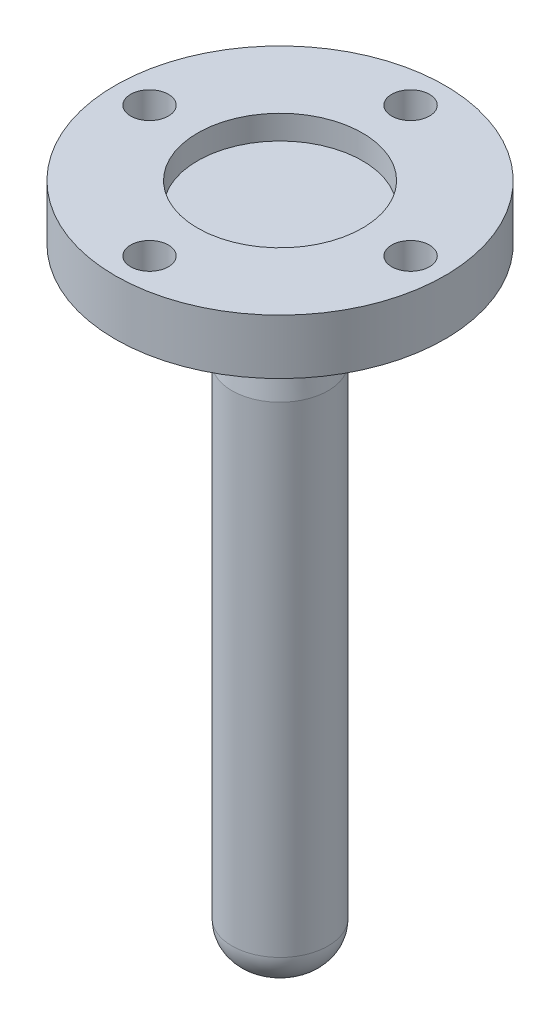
ISO-10303-21;
HEADER;
FILE_DESCRIPTION(('STEP AP214'),'2;1');
FILE_NAME('part.step','',(''),(''),'','','');
FILE_SCHEMA(('AUTOMOTIVE_DESIGN { 1 0 10303 214 1 1 1 1 }'));
ENDSEC;
DATA;
#1=APPLICATION_CONTEXT('core data for automotive mechanical design processes');
#2=APPLICATION_PROTOCOL_DEFINITION('international standard','automotive_design',2000,#1);
#3=PRODUCT_CONTEXT('',#1,'mechanical');
#4=PRODUCT('Part','Part','',(#3));
#5=PRODUCT_RELATED_PRODUCT_CATEGORY('part','',(#4));
#6=PRODUCT_DEFINITION_FORMATION('','',#4);
#7=PRODUCT_DEFINITION_CONTEXT('part definition',#1,'design');
#8=PRODUCT_DEFINITION('design','',#6,#7);
#9=PRODUCT_DEFINITION_SHAPE('','',#8);
#10=(LENGTH_UNIT() NAMED_UNIT(*) SI_UNIT(.MILLI.,.METRE.));
#11=(NAMED_UNIT(*) PLANE_ANGLE_UNIT() SI_UNIT($,.RADIAN.));
#12=(NAMED_UNIT(*) SI_UNIT($,.STERADIAN.) SOLID_ANGLE_UNIT());
#13=UNCERTAINTY_MEASURE_WITH_UNIT(LENGTH_MEASURE(1.E-05),#10,'distance_accuracy_value','');
#14=(GEOMETRIC_REPRESENTATION_CONTEXT(3) GLOBAL_UNCERTAINTY_ASSIGNED_CONTEXT((#13)) GLOBAL_UNIT_ASSIGNED_CONTEXT((#10,
#11,#12)) REPRESENTATION_CONTEXT('',''));
#15=CARTESIAN_POINT('',(0.,0.,0.));
#16=DIRECTION('',(0.,0.,1.));
#17=DIRECTION('',(1.,0.,0.));
#18=AXIS2_PLACEMENT_3D('',#15,#16,#17);
#19=CARTESIAN_POINT('',(0.,8.,0.));
#20=DIRECTION('',(0.,-1.,0.));
#21=DIRECTION('',(0.,0.,-1.));
#22=AXIS2_PLACEMENT_3D('',#19,#20,#21);
#23=CYLINDRICAL_SURFACE('',#22,24.);
#24=CARTESIAN_POINT('',(0.,8.,0.));
#25=DIRECTION('',(0.,1.,0.));
#26=DIRECTION('',(0.,0.,1.));
#27=AXIS2_PLACEMENT_3D('',#24,#25,#26);
#28=CIRCLE('',#27,24.);
#29=CARTESIAN_POINT('',(0.,8.,24.));
#30=VERTEX_POINT('',#29);
#31=EDGE_CURVE('E48',#30,#30,#28,.T.);
#32=ORIENTED_EDGE('',*,*,#31,.F.);
#33=EDGE_LOOP('',(#32));
#34=FACE_BOUND('',#33,.T.);
#35=CARTESIAN_POINT('',(0.,0.,0.));
#36=DIRECTION('',(0.,1.,0.));
#37=DIRECTION('',(0.,0.,1.));
#38=AXIS2_PLACEMENT_3D('',#35,#36,#37);
#39=CIRCLE('',#38,24.);
#40=CARTESIAN_POINT('',(0.,0.,24.));
#41=VERTEX_POINT('',#40);
#42=EDGE_CURVE('E51',#41,#41,#39,.T.);
#43=ORIENTED_EDGE('',*,*,#42,.T.);
#44=EDGE_LOOP('',(#43));
#45=FACE_BOUND('',#44,.T.);
#46=ADVANCED_FACE('F33',(#34,#45),#23,.T.);
#47=CARTESIAN_POINT('',(0.,8.,0.));
#48=DIRECTION('',(0.,1.,0.));
#49=DIRECTION('',(0.,0.,1.));
#50=AXIS2_PLACEMENT_3D('',#47,#48,#49);
#51=PLANE('',#50);
#52=CARTESIAN_POINT('',(-1.99014436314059E-13,8.,19.));
#53=DIRECTION('',(0.,1.,0.));
#54=DIRECTION('',(0.,0.,1.));
#55=AXIS2_PLACEMENT_3D('',#52,#53,#54);
#56=CIRCLE('',#55,2.75);
#57=CARTESIAN_POINT('',(-1.99014436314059E-13,8.,21.75));
#58=VERTEX_POINT('',#57);
#59=EDGE_CURVE('E84',#58,#58,#56,.T.);
#60=ORIENTED_EDGE('',*,*,#59,.F.);
#61=EDGE_LOOP('',(#60));
#62=FACE_BOUND('',#61,.T.);
#63=CARTESIAN_POINT('',(19.,8.,1.32676290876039E-13));
#64=DIRECTION('',(0.,1.,0.));
#65=DIRECTION('',(0.,0.,1.));
#66=AXIS2_PLACEMENT_3D('',#63,#64,#65);
#67=CIRCLE('',#66,2.75);
#68=CARTESIAN_POINT('',(19.,8.,2.75000000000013));
#69=VERTEX_POINT('',#68);
#70=EDGE_CURVE('E78',#69,#69,#67,.T.);
#71=ORIENTED_EDGE('',*,*,#70,.F.);
#72=EDGE_LOOP('',(#71));
#73=FACE_BOUND('',#72,.T.);
#74=CARTESIAN_POINT('',(0.,8.,-19.));
#75=DIRECTION('',(0.,1.,0.));
#76=DIRECTION('',(0.,0.,1.));
#77=AXIS2_PLACEMENT_3D('',#74,#75,#76);
#78=CIRCLE('',#77,2.75);
#79=CARTESIAN_POINT('',(0.,8.,-16.25));
#80=VERTEX_POINT('',#79);
#81=EDGE_CURVE('E72',#80,#80,#78,.T.);
#82=ORIENTED_EDGE('',*,*,#81,.F.);
#83=EDGE_LOOP('',(#82));
#84=FACE_BOUND('',#83,.T.);
#85=CARTESIAN_POINT('',(-19.,8.,0.));
#86=DIRECTION('',(0.,1.,0.));
#87=DIRECTION('',(0.,0.,1.));
#88=AXIS2_PLACEMENT_3D('',#85,#86,#87);
#89=CIRCLE('',#88,2.75);
#90=CARTESIAN_POINT('',(-19.,8.,2.75));
#91=VERTEX_POINT('',#90);
#92=EDGE_CURVE('E66',#91,#91,#89,.T.);
#93=ORIENTED_EDGE('',*,*,#92,.F.);
#94=EDGE_LOOP('',(#93));
#95=FACE_BOUND('',#94,.T.);
#96=CARTESIAN_POINT('',(0.,8.,0.));
#97=DIRECTION('',(0.,1.,0.));
#98=DIRECTION('',(0.,0.,1.));
#99=AXIS2_PLACEMENT_3D('',#96,#97,#98);
#100=CIRCLE('',#99,12.);
#101=CARTESIAN_POINT('',(0.,8.,12.));
#102=VERTEX_POINT('',#101);
#103=EDGE_CURVE('E60',#102,#102,#100,.T.);
#104=ORIENTED_EDGE('',*,*,#103,.F.);
#105=EDGE_LOOP('',(#104));
#106=FACE_BOUND('',#105,.T.);
#107=ORIENTED_EDGE('',*,*,#31,.T.);
#108=EDGE_LOOP('',(#107));
#109=FACE_BOUND('',#108,.T.);
#110=ADVANCED_FACE('F99',(#62,#73,#84,#95,#106,#109),#51,.T.);
#111=CARTESIAN_POINT('',(0.,0.,0.));
#112=DIRECTION('',(0.,1.,0.));
#113=DIRECTION('',(0.,0.,1.));
#114=AXIS2_PLACEMENT_3D('',#111,#112,#113);
#115=PLANE('',#114);
#116=CARTESIAN_POINT('',(0.,0.,0.));
#117=DIRECTION('',(0.,1.,0.));
#118=DIRECTION('',(0.,0.,1.));
#119=AXIS2_PLACEMENT_3D('',#116,#117,#118);
#120=CIRCLE('',#119,5.);
#121=CARTESIAN_POINT('',(0.,0.,5.));
#122=VERTEX_POINT('',#121);
#123=EDGE_CURVE('E44',#122,#122,#120,.F.);
#124=ORIENTED_EDGE('',*,*,#123,.F.);
#125=EDGE_LOOP('',(#124));
#126=FACE_BOUND('',#125,.T.);
#127=ORIENTED_EDGE('',*,*,#42,.F.);
#128=EDGE_LOOP('',(#127));
#129=FACE_BOUND('',#128,.T.);
#130=ADVANCED_FACE('F102',(#126,#129),#115,.F.);
#131=CARTESIAN_POINT('',(0.,-90.,0.));
#132=DIRECTION('',(0.,1.,0.));
#133=DIRECTION('',(-1.,0.,0.));
#134=AXIS2_PLACEMENT_3D('',#131,#132,#133);
#135=PLANE('',#134);
#136=CARTESIAN_POINT('',(0.,-90.,0.));
#137=DIRECTION('',(0.,1.,0.));
#138=DIRECTION('',(-1.,0.,0.));
#139=AXIS2_PLACEMENT_3D('',#136,#137,#138);
#140=CIRCLE('',#139,2.);
#141=CARTESIAN_POINT('',(-1.99999999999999,-90.,0.));
#142=VERTEX_POINT('',#141);
#143=EDGE_CURVE('E10',#142,#142,#140,.F.);
#144=ORIENTED_EDGE('',*,*,#143,.T.);
#145=EDGE_LOOP('',(#144));
#146=FACE_BOUND('',#145,.T.);
#147=ADVANCED_FACE('F119',(#146),#135,.F.);
#148=CARTESIAN_POINT('',(0.,0.,0.));
#149=DIRECTION('',(0.,1.,0.));
#150=DIRECTION('',(-1.,0.,0.));
#151=AXIS2_PLACEMENT_3D('',#148,#149,#150);
#152=CYLINDRICAL_SURFACE('',#151,7.);
#153=CARTESIAN_POINT('',(0.,-85.,0.));
#154=DIRECTION('',(0.,1.,0.));
#155=DIRECTION('',(-1.,0.,0.));
#156=AXIS2_PLACEMENT_3D('',#153,#154,#155);
#157=CIRCLE('',#156,7.);
#158=CARTESIAN_POINT('',(-6.99999999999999,-85.,0.));
#159=VERTEX_POINT('',#158);
#160=EDGE_CURVE('E40',#159,#159,#157,.T.);
#161=ORIENTED_EDGE('',*,*,#160,.T.);
#162=EDGE_LOOP('',(#161));
#163=FACE_BOUND('',#162,.T.);
#164=CARTESIAN_POINT('',(0.,-15.,0.));
#165=DIRECTION('',(0.,1.,0.));
#166=DIRECTION('',(-1.,0.,0.));
#167=AXIS2_PLACEMENT_3D('',#164,#165,#166);
#168=CIRCLE('',#167,7.00000000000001);
#169=CARTESIAN_POINT('',(-7.00000000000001,-15.,0.));
#170=VERTEX_POINT('',#169);
#171=EDGE_CURVE('E54',#170,#170,#168,.T.);
#172=ORIENTED_EDGE('',*,*,#171,.F.);
#173=EDGE_LOOP('',(#172));
#174=FACE_BOUND('',#173,.T.);
#175=ADVANCED_FACE('F125',(#163,#174),#152,.T.);
#176=CARTESIAN_POINT('',(0.,-15.,0.));
#177=DIRECTION('',(0.,-1.,0.));
#178=DIRECTION('',(1.,0.,0.));
#179=AXIS2_PLACEMENT_3D('',#176,#177,#178);
#180=CONICAL_SURFACE('',#179,7.00000000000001,0.132551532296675);
#181=ORIENTED_EDGE('',*,*,#123,.T.);
#182=EDGE_LOOP('',(#181));
#183=FACE_BOUND('',#182,.T.);
#184=ORIENTED_EDGE('',*,*,#171,.T.);
#185=EDGE_LOOP('',(#184));
#186=FACE_BOUND('',#185,.T.);
#187=ADVANCED_FACE('F131',(#183,#186),#180,.T.);
#188=CARTESIAN_POINT('',(0.,-85.,0.));
#189=DIRECTION('',(0.,1.,0.));
#190=DIRECTION('',(-1.,0.,0.));
#191=AXIS2_PLACEMENT_3D('',#188,#189,#190);
#192=DEGENERATE_TOROIDAL_SURFACE('',#191,2.,5.,.T.);
#193=ORIENTED_EDGE('',*,*,#143,.F.);
#194=EDGE_LOOP('',(#193));
#195=FACE_BOUND('',#194,.T.);
#196=ORIENTED_EDGE('',*,*,#160,.F.);
#197=EDGE_LOOP('',(#196));
#198=FACE_BOUND('',#197,.T.);
#199=ADVANCED_FACE('F35',(#195,#198),#192,.T.);
#200=CARTESIAN_POINT('',(0.,4.5,0.));
#201=DIRECTION('',(0.,1.,0.));
#202=DIRECTION('',(0.,0.,1.));
#203=AXIS2_PLACEMENT_3D('',#200,#201,#202);
#204=CYLINDRICAL_SURFACE('',#203,12.);
#205=CARTESIAN_POINT('',(0.,4.5,0.));
#206=DIRECTION('',(0.,1.,0.));
#207=DIRECTION('',(0.,0.,1.));
#208=AXIS2_PLACEMENT_3D('',#205,#206,#207);
#209=CIRCLE('',#208,12.);
#210=CARTESIAN_POINT('',(0.,4.5,12.));
#211=VERTEX_POINT('',#210);
#212=EDGE_CURVE('E59',#211,#211,#209,.T.);
#213=ORIENTED_EDGE('',*,*,#212,.F.);
#214=EDGE_LOOP('',(#213));
#215=FACE_BOUND('',#214,.T.);
#216=ORIENTED_EDGE('',*,*,#103,.T.);
#217=EDGE_LOOP('',(#216));
#218=FACE_BOUND('',#217,.T.);
#219=ADVANCED_FACE('F135',(#215,#218),#204,.F.);
#220=CARTESIAN_POINT('',(0.,4.5,0.));
#221=DIRECTION('',(0.,1.,0.));
#222=DIRECTION('',(0.,0.,1.));
#223=AXIS2_PLACEMENT_3D('',#220,#221,#222);
#224=PLANE('',#223);
#225=ORIENTED_EDGE('',*,*,#212,.T.);
#226=EDGE_LOOP('',(#225));
#227=FACE_BOUND('',#226,.T.);
#228=ADVANCED_FACE('F138',(#227),#224,.T.);
#229=CARTESIAN_POINT('',(-19.,2.5,0.));
#230=DIRECTION('',(0.,1.,0.));
#231=DIRECTION('',(0.,0.,1.));
#232=AXIS2_PLACEMENT_3D('',#229,#230,#231);
#233=CYLINDRICAL_SURFACE('',#232,2.75);
#234=CARTESIAN_POINT('',(-19.,2.5,0.));
#235=DIRECTION('',(0.,1.,0.));
#236=DIRECTION('',(0.,0.,1.));
#237=AXIS2_PLACEMENT_3D('',#234,#235,#236);
#238=CIRCLE('',#237,2.75);
#239=CARTESIAN_POINT('',(-19.,2.5,2.75));
#240=VERTEX_POINT('',#239);
#241=EDGE_CURVE('E63',#240,#240,#238,.T.);
#242=ORIENTED_EDGE('',*,*,#241,.F.);
#243=EDGE_LOOP('',(#242));
#244=FACE_BOUND('',#243,.T.);
#245=ORIENTED_EDGE('',*,*,#92,.T.);
#246=EDGE_LOOP('',(#245));
#247=FACE_BOUND('',#246,.T.);
#248=ADVANCED_FACE('F142',(#244,#247),#233,.F.);
#249=CARTESIAN_POINT('',(-19.,2.5,0.));
#250=DIRECTION('',(0.,1.,0.));
#251=DIRECTION('',(0.,0.,1.));
#252=AXIS2_PLACEMENT_3D('',#249,#250,#251);
#253=PLANE('',#252);
#254=ORIENTED_EDGE('',*,*,#241,.T.);
#255=EDGE_LOOP('',(#254));
#256=FACE_BOUND('',#255,.T.);
#257=ADVANCED_FACE('F146',(#256),#253,.T.);
#258=CARTESIAN_POINT('',(0.,2.5,-19.));
#259=DIRECTION('',(0.,1.,0.));
#260=DIRECTION('',(0.,0.,1.));
#261=AXIS2_PLACEMENT_3D('',#258,#259,#260);
#262=CYLINDRICAL_SURFACE('',#261,2.75);
#263=CARTESIAN_POINT('',(0.,2.5,-19.));
#264=DIRECTION('',(0.,1.,0.));
#265=DIRECTION('',(0.,0.,1.));
#266=AXIS2_PLACEMENT_3D('',#263,#264,#265);
#267=CIRCLE('',#266,2.75);
#268=CARTESIAN_POINT('',(0.,2.5,-16.25));
#269=VERTEX_POINT('',#268);
#270=EDGE_CURVE('E69',#269,#269,#267,.T.);
#271=ORIENTED_EDGE('',*,*,#270,.F.);
#272=EDGE_LOOP('',(#271));
#273=FACE_BOUND('',#272,.T.);
#274=ORIENTED_EDGE('',*,*,#81,.T.);
#275=EDGE_LOOP('',(#274));
#276=FACE_BOUND('',#275,.T.);
#277=ADVANCED_FACE('F150',(#273,#276),#262,.F.);
#278=CARTESIAN_POINT('',(0.,2.5,-19.));
#279=DIRECTION('',(0.,1.,0.));
#280=DIRECTION('',(0.,0.,1.));
#281=AXIS2_PLACEMENT_3D('',#278,#279,#280);
#282=PLANE('',#281);
#283=ORIENTED_EDGE('',*,*,#270,.T.);
#284=EDGE_LOOP('',(#283));
#285=FACE_BOUND('',#284,.T.);
#286=ADVANCED_FACE('F154',(#285),#282,.T.);
#287=CARTESIAN_POINT('',(19.,2.5,1.32676290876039E-13));
#288=DIRECTION('',(0.,1.,0.));
#289=DIRECTION('',(0.,0.,1.));
#290=AXIS2_PLACEMENT_3D('',#287,#288,#289);
#291=CYLINDRICAL_SURFACE('',#290,2.75);
#292=CARTESIAN_POINT('',(19.,2.5,1.32676290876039E-13));
#293=DIRECTION('',(0.,1.,0.));
#294=DIRECTION('',(0.,0.,1.));
#295=AXIS2_PLACEMENT_3D('',#292,#293,#294);
#296=CIRCLE('',#295,2.75);
#297=CARTESIAN_POINT('',(19.,2.5,2.75000000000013));
#298=VERTEX_POINT('',#297);
#299=EDGE_CURVE('E75',#298,#298,#296,.T.);
#300=ORIENTED_EDGE('',*,*,#299,.F.);
#301=EDGE_LOOP('',(#300));
#302=FACE_BOUND('',#301,.T.);
#303=ORIENTED_EDGE('',*,*,#70,.T.);
#304=EDGE_LOOP('',(#303));
#305=FACE_BOUND('',#304,.T.);
#306=ADVANCED_FACE('F158',(#302,#305),#291,.F.);
#307=CARTESIAN_POINT('',(19.,2.5,1.32676290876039E-13));
#308=DIRECTION('',(0.,1.,0.));
#309=DIRECTION('',(0.,0.,1.));
#310=AXIS2_PLACEMENT_3D('',#307,#308,#309);
#311=PLANE('',#310);
#312=ORIENTED_EDGE('',*,*,#299,.T.);
#313=EDGE_LOOP('',(#312));
#314=FACE_BOUND('',#313,.T.);
#315=ADVANCED_FACE('F95',(#314),#311,.T.);
#316=CARTESIAN_POINT('',(-1.99014436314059E-13,2.5,19.));
#317=DIRECTION('',(0.,1.,0.));
#318=DIRECTION('',(0.,0.,1.));
#319=AXIS2_PLACEMENT_3D('',#316,#317,#318);
#320=CYLINDRICAL_SURFACE('',#319,2.75);
#321=CARTESIAN_POINT('',(-1.99014436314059E-13,2.5,19.));
#322=DIRECTION('',(0.,1.,0.));
#323=DIRECTION('',(0.,0.,1.));
#324=AXIS2_PLACEMENT_3D('',#321,#322,#323);
#325=CIRCLE('',#324,2.75);
#326=CARTESIAN_POINT('',(-1.99014436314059E-13,2.5,21.75));
#327=VERTEX_POINT('',#326);
#328=EDGE_CURVE('E81',#327,#327,#325,.T.);
#329=ORIENTED_EDGE('',*,*,#328,.F.);
#330=EDGE_LOOP('',(#329));
#331=FACE_BOUND('',#330,.T.);
#332=ORIENTED_EDGE('',*,*,#59,.T.);
#333=EDGE_LOOP('',(#332));
#334=FACE_BOUND('',#333,.T.);
#335=ADVANCED_FACE('F92',(#331,#334),#320,.F.);
#336=CARTESIAN_POINT('',(-1.99014436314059E-13,2.5,19.));
#337=DIRECTION('',(0.,1.,0.));
#338=DIRECTION('',(0.,0.,1.));
#339=AXIS2_PLACEMENT_3D('',#336,#337,#338);
#340=PLANE('',#339);
#341=ORIENTED_EDGE('',*,*,#328,.T.);
#342=EDGE_LOOP('',(#341));
#343=FACE_BOUND('',#342,.T.);
#344=ADVANCED_FACE('F90',(#343),#340,.T.);
#345=CLOSED_SHELL('',(#46,#110,#130,#147,#175,#187,#199,#219,#228,#248,#257,#277,#286,#306,#315,
#335,#344));
#346=MANIFOLD_SOLID_BREP('B2',#345);
#347=ADVANCED_BREP_SHAPE_REPRESENTATION('',(#18,#346),#14);
#348=SHAPE_DEFINITION_REPRESENTATION(#9,#347);
ENDSEC;
END-ISO-10303-21;
